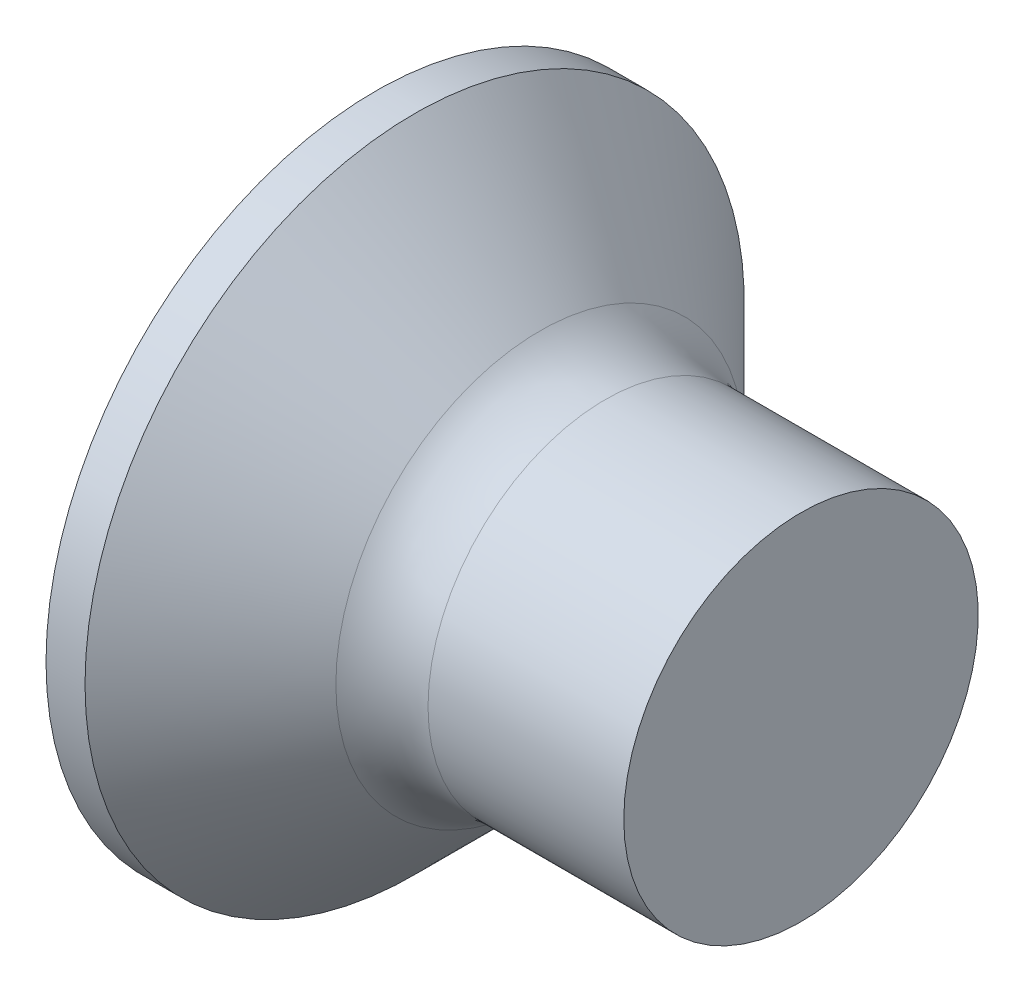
from build123d import *

# Parameters (mm, degrees)
FILLET1_R    = 1.3
RECPAT_COUNT = 2
RECPAT_ANGLE = 90


with BuildPart() as part:
    # BodySke → Base-Revolve (revolve)
    with BuildSketch(Plane.XY, mode=Mode.PRIVATE) as base_revolve_sk:
        Polygon((0, 0), (0, 4.65), (0.55, 4.65), (2.7, 2.5), (6, 2.5), (6, 0), align=None)
    revolve(base_revolve_sk.sketch.rotate(Axis((-6.35, 0, 0), (1, 0, 0)), 90), axis=Axis((-6.35, 0, 0), (1, 0, 0)))

    # Fillet1
    fillet1_edges = [part.edges().sort_by_distance(p)[0] for p in [
        (2.7, 0, -2.5),
    ]]
    fillet(fillet1_edges, radius=FILLET1_R)

    # Sketch3 → Recess section 0
    with BuildSketch(Plane.ZY):
        with BuildLine():
            Line((-0.515, 2.45), (0.515, 2.45))
            Line((0.515, 2.45), (0.515, -2.45))
            Line((0.515, -2.45), (-0.515, -2.45))
            Line((-0.515, -2.45), (-0.515, 2.45))
        make_face()
    # Sketch4 → Recess section 1
    with BuildSketch(Plane.ZY.offset(-3.05)):
        with BuildLine():
            Line((-0.515, 0.929326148), (0.515, 0.929326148))
            Line((0.515, 0.929326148), (0.515, -0.929326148))
            Line((0.515, -0.929326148), (-0.515, -0.929326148))
            Line((-0.515, -0.929326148), (-0.515, 0.929326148))
        make_face()
    recess = loft(mode=Mode.SUBTRACT)

    # RecPat: Recess ×2 about axis
    recpat_axis = Axis((0, 0, 0), (1, 0, 0))
    for i in range(1, RECPAT_COUNT):
        add(recess.rotate(recpat_axis, i * RECPAT_ANGLE / (RECPAT_COUNT - 1)), mode=Mode.SUBTRACT)

    # RecCorSke → RecessCore (revolve, cut)
    with BuildSketch(Plane.XY, mode=Mode.PRIVATE) as recesscore_sk:
        Polygon((0, 0), (0, 1.064276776), (3.05, 0.851), (3.326506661, 0), align=None)
    revolve(recesscore_sk.sketch.rotate(Axis((-3.175, 0, 0), (1, 0, 0)), 90), axis=Axis((-3.175, 0, 0), (1, 0, 0)), mode=Mode.SUBTRACT)


solid = part.part
